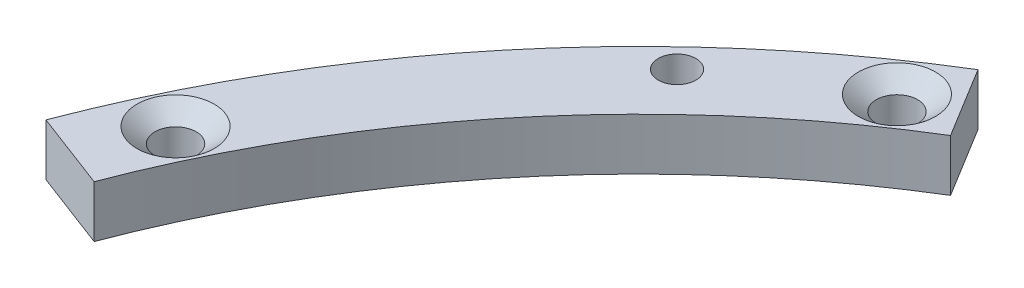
from build123d import *

# Parameters (mm, degrees)
SKETCH1_R                                         = 1.7272
EXTRUDE1_DEPTH                                    = 4.7625
CSK_FOR_6_FLAT_HEAD_MACHINE_SCREW_100_D           = 3.7973
CSK_FOR_6_FLAT_HEAD_MACHINE_SCREW_100_CSINK_D     = 7.0866
CSK_FOR_6_FLAT_HEAD_MACHINE_SCREW_100_CSINK_ANGLE = 100


with BuildPart() as part:
    # Sketch1 → Extrude1 (new body)
    with BuildSketch(Plane(origin=(0, 0, 0), x_dir=(1, 0, 0), z_dir=(0, 1, 0))):
        with BuildLine():
            Line((-80.733485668, 30.66192903), (-87.857028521, 33.367393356))
            ThreePointArc((-87.857028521, 33.367393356), (-72.342433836, 59.99010474), (-49.050981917, 80.163842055))
            Line((-49.050981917, 80.163842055), (-45.073875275, 73.664071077))
            ThreePointArc((-45.073875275, 73.664071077), (-66.476831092, 55.126042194), (-80.733485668, 30.66192903))
        make_face()
        with Locations(Location((-62.898908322, 66.370181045, 0), (0, 0, 90))):
            Circle(SKETCH1_R, mode=Mode.SUBTRACT)
    extrude(amount=EXTRUDE1_DEPTH)

    # CSK for _6 Flat Head Machine Screw _100 (through all)
    with Locations(Plane(origin=(0, 4.7625, 0), x_dir=(-1, 0, 0), z_dir=(0, 1, 0))):
        with Locations((50.817706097, -74.486170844), (81.393225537, -38.804274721)):
            CounterSinkHole(CSK_FOR_6_FLAT_HEAD_MACHINE_SCREW_100_D / 2, CSK_FOR_6_FLAT_HEAD_MACHINE_SCREW_100_CSINK_D / 2, counter_sink_angle=CSK_FOR_6_FLAT_HEAD_MACHINE_SCREW_100_CSINK_ANGLE)


solid = part.part
